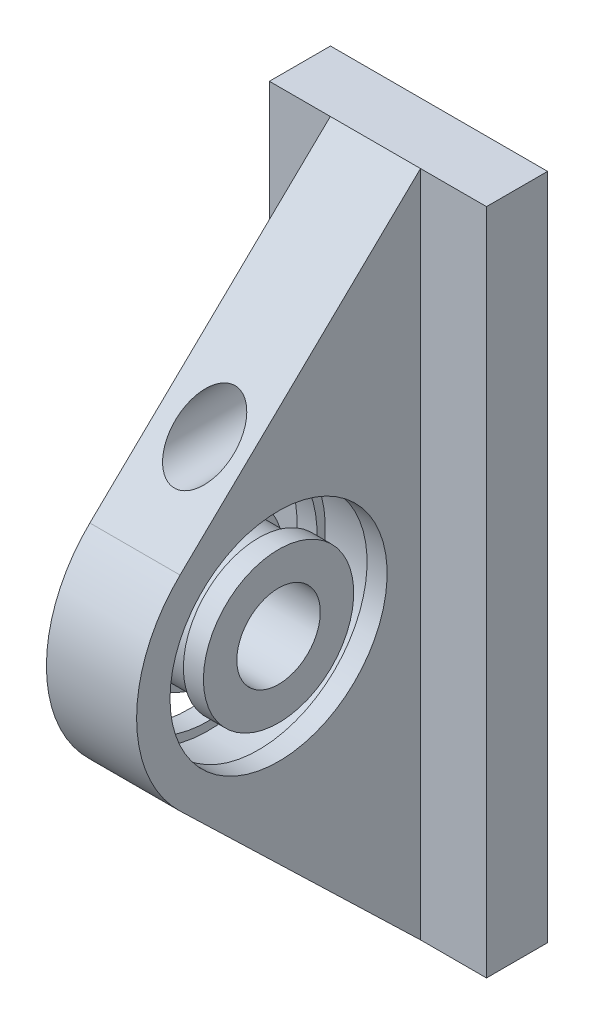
from build123d import *

# Parameters (mm, degrees)
BOSS_EXTRUDE2_DEPTH      = 3.95
BOSS_EXTRUDE2_DEPTH_BACK = 9.05
SKETCH4_W                = 3.65785502
SKETCH4_H                = 40
BOSS_EXTRUDE3_DEPTH      = 2.7
SKETCH7_R                = 1.75
CUT_EXTRUDE1_DEPTH       = 25.4


with BuildPart() as part:
    # Sketch1 → Revolve1 (revolve)
    with BuildSketch(Plane.XY, mode=Mode.PRIVATE) as revolve1_sk:
        Polygon((19.238002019, 8.490100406), (19.238002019, 10.490100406), (24.638002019, 10.490100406), (24.638002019, 8.490100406), (23.438002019, 8.490100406), (23.438002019, 8.990100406), (20.438002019, 8.990100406), (20.438002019, 8.490100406), align=None)
        Polygon((19.238002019, 4.490100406), (24.638002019, 4.490100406), (24.638002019, 6.490100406), (23.438002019, 6.490100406), (23.438002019, 5.990100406), (20.438002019, 5.990100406), (20.438002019, 6.490100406), (19.238002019, 6.490100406), align=None)
    revolve(revolve1_sk.sketch.rotate(Axis((17.185637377, 1.990100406, 0), (1, 0, 0)), 90), axis=Axis((17.185637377, 1.990100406, 0), (1, 0, 0)))



with BuildPart() as body_2:
    # Sketch4 → Boss-Extrude2 (new, two sides: drawn at the far end of the back side and taken through both)
    with BuildSketch(Plane(origin=(24.638002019, 0, 0), x_dir=(0, 0, -1), z_dir=(1, 0, 0)).offset(-BOSS_EXTRUDE2_DEPTH_BACK)):
        with Locations((10.32892751, 1.990100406)):
            Rectangle(SKETCH4_W, SKETCH4_H)
    extrude(amount=BOSS_EXTRUDE2_DEPTH + BOSS_EXTRUDE2_DEPTH_BACK)


with BuildPart() as part_1:
    add(part.part)

    add(body_2.part)  # Boss-Extrude3 merges body 2
    # Sketch6 → Boss-Extrude3 (add, symmetric)
    with BuildSketch(Plane.ZY.offset(-21.938002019)):
        with BuildLine():
            Line((-8.5, -18.009899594), (5.899148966, -4.129543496))
            ThreePointArc((5.899148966, -4.129543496), (-3.324699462, -5.832714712), (-8.5, 1.990100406))
            Line((-8.5, 1.990100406), (-8.5, -18.009899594))
        make_face()
    boss_extrude3 = extrude(amount=BOSS_EXTRUDE3_DEPTH, both=True)

    # Mirror1: Boss-Extrude3 across plane
    add(boss_extrude3.mirror(Plane.ZX.offset(1.990100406)))

    # Sketch7 → Cut-Extrude1 (cut)
    with BuildSketch(Plane(origin=(0, 0, -12.15785502), x_dir=(-1, 0, 0), z_dir=(0, 0, -1))):
        with Locations(Location((-22.088002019, 11.990100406, 0), (0, 0, 90))):
            Circle(SKETCH7_R)
        with Locations(Location((-22.088002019, -8.009899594, 0), (0, 0, 90))):
            Circle(SKETCH7_R)
    extrude(amount=-CUT_EXTRUDE1_DEPTH, mode=Mode.SUBTRACT)


solid = part_1.part
